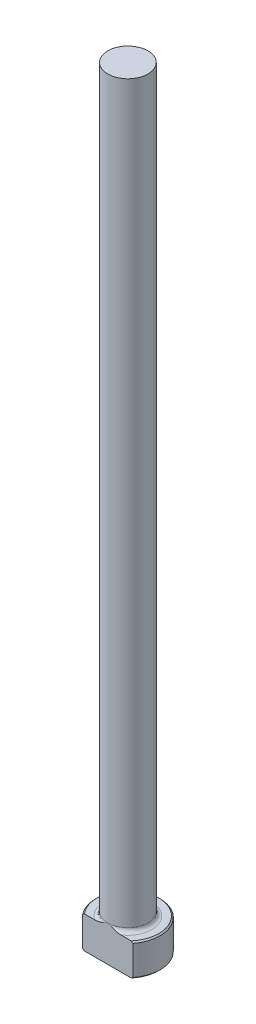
from build123d import *

# Parameters (mm, degrees)
CHAMFER1_SIZE = 0.254
FILLET1_R     = 0.762
KEY_DEPTH     = 153.664354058


with BuildPart() as part:
    # Sketch1 → Revolve1 (revolve)
    with BuildSketch(Plane.XY, mode=Mode.PRIVATE) as revolve1_sk:
        Polygon((0, 0), (-6.35, 0), (-6.35, 6.35), (-3.96875, 6.35), (-3.96875, 152.4), (0, 152.4), align=None)
    revolve(revolve1_sk.sketch.rotate(Axis((0, 259.958771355, 0), (0, -1, 0)), 270), axis=Axis((0, 259.958771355, 0), (0, -1, 0)))

    # Chamfer1
    chamfer1_edges = [part.edges().sort_by_distance(p)[0] for p in [
        (0, 6.35, -6.35),
        (0, 0, -6.35),
    ]]
    chamfer(chamfer1_edges, length=CHAMFER1_SIZE)

    # Fillet1
    fillet1_edges = [part.edges().sort_by_distance(p)[0] for p in [
        (0, 6.35, -3.96875),
    ]]
    fillet(fillet1_edges, radius=FILLET1_R)

    # Sketch2 → KEY (cut, through all)
    with BuildSketch(Plane.XZ):
        with BuildLine():
            Line((-4.956967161, 3.96875), (4.956967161, 3.96875))
            ThreePointArc((4.956967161, 3.96875), (0, 6.35), (-4.956967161, 3.96875))
        make_face()
    extrude(amount=-KEY_DEPTH, mode=Mode.SUBTRACT)


solid = part.part
